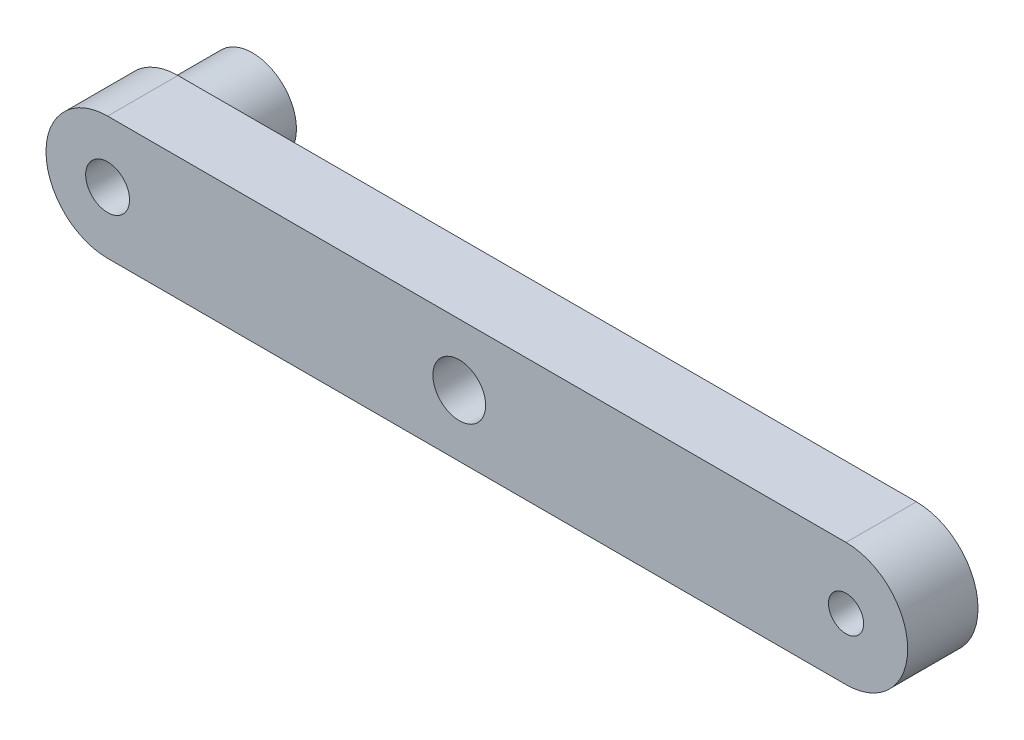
ISO-10303-21;
HEADER;
FILE_DESCRIPTION(('STEP AP214'),'2;1');
FILE_NAME('part.step','',(''),(''),'','','');
FILE_SCHEMA(('AUTOMOTIVE_DESIGN { 1 0 10303 214 1 1 1 1 }'));
ENDSEC;
DATA;
#1=APPLICATION_CONTEXT('core data for automotive mechanical design processes');
#2=APPLICATION_PROTOCOL_DEFINITION('international standard','automotive_design',2000,#1);
#3=PRODUCT_CONTEXT('',#1,'mechanical');
#4=PRODUCT('Part','Part','',(#3));
#5=PRODUCT_RELATED_PRODUCT_CATEGORY('part','',(#4));
#6=PRODUCT_DEFINITION_FORMATION('','',#4);
#7=PRODUCT_DEFINITION_CONTEXT('part definition',#1,'design');
#8=PRODUCT_DEFINITION('design','',#6,#7);
#9=PRODUCT_DEFINITION_SHAPE('','',#8);
#10=(LENGTH_UNIT() NAMED_UNIT(*) SI_UNIT(.MILLI.,.METRE.));
#11=(NAMED_UNIT(*) PLANE_ANGLE_UNIT() SI_UNIT($,.RADIAN.));
#12=(NAMED_UNIT(*) SI_UNIT($,.STERADIAN.) SOLID_ANGLE_UNIT());
#13=UNCERTAINTY_MEASURE_WITH_UNIT(LENGTH_MEASURE(1.E-05),#10,'distance_accuracy_value','');
#14=(GEOMETRIC_REPRESENTATION_CONTEXT(3) GLOBAL_UNCERTAINTY_ASSIGNED_CONTEXT((#13)) GLOBAL_UNIT_ASSIGNED_CONTEXT((#10,
#11,#12)) REPRESENTATION_CONTEXT('',''));
#15=CARTESIAN_POINT('',(0.,0.,0.));
#16=DIRECTION('',(0.,0.,1.));
#17=DIRECTION('',(1.,0.,0.));
#18=AXIS2_PLACEMENT_3D('',#15,#16,#17);
#19=CARTESIAN_POINT('',(-63.5,0.,-13.462));
#20=DIRECTION('',(0.,0.,1.));
#21=DIRECTION('',(1.,0.,0.));
#22=AXIS2_PLACEMENT_3D('',#19,#20,#21);
#23=CYLINDRICAL_SURFACE('',#22,7.93749999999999);
#24=CARTESIAN_POINT('',(-63.5,0.,-13.462));
#25=DIRECTION('',(0.,0.,1.));
#26=DIRECTION('',(1.,0.,0.));
#27=AXIS2_PLACEMENT_3D('',#24,#25,#26);
#28=CIRCLE('',#27,7.93749999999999);
#29=CARTESIAN_POINT('',(-55.5625,0.,-13.462));
#30=VERTEX_POINT('',#29);
#31=EDGE_CURVE('E11',#30,#30,#28,.T.);
#32=ORIENTED_EDGE('',*,*,#31,.T.);
#33=EDGE_LOOP('',(#32));
#34=FACE_BOUND('',#33,.T.);
#35=CARTESIAN_POINT('',(-63.5,0.,0.));
#36=DIRECTION('',(0.,0.,1.));
#37=DIRECTION('',(1.,0.,0.));
#38=AXIS2_PLACEMENT_3D('',#35,#36,#37);
#39=CIRCLE('',#38,7.93749999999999);
#40=CARTESIAN_POINT('',(-55.5625,0.,0.));
#41=VERTEX_POINT('',#40);
#42=EDGE_CURVE('E48',#41,#41,#39,.T.);
#43=ORIENTED_EDGE('',*,*,#42,.F.);
#44=EDGE_LOOP('',(#43));
#45=FACE_BOUND('',#44,.T.);
#46=ADVANCED_FACE('F45',(#34,#45),#23,.T.);
#47=CARTESIAN_POINT('',(-63.5,0.,-13.462));
#48=DIRECTION('',(0.,0.,1.));
#49=DIRECTION('',(1.,0.,0.));
#50=AXIS2_PLACEMENT_3D('',#47,#48,#49);
#51=PLANE('',#50);
#52=ORIENTED_EDGE('',*,*,#31,.F.);
#53=EDGE_LOOP('',(#52));
#54=FACE_BOUND('',#53,.T.);
#55=ADVANCED_FACE('F60',(#54),#51,.F.);
#56=CARTESIAN_POINT('',(-63.5,0.,0.));
#57=DIRECTION('',(0.,0.,1.));
#58=DIRECTION('',(1.,0.,0.));
#59=AXIS2_PLACEMENT_3D('',#56,#57,#58);
#60=PLANE('',#59);
#61=ORIENTED_EDGE('',*,*,#42,.T.);
#62=EDGE_LOOP('',(#61));
#63=FACE_BOUND('',#62,.T.);
#64=ADVANCED_FACE('F57',(#63),#60,.T.);
#65=CLOSED_SHELL('',(#46,#55,#64));
#66=MANIFOLD_SOLID_BREP('B2',#65);
#67=CARTESIAN_POINT('',(-63.5,0.,12.7));
#68=DIRECTION('',(0.,0.,1.));
#69=DIRECTION('',(1.,0.,0.));
#70=AXIS2_PLACEMENT_3D('',#67,#68,#69);
#71=PLANE('',#70);
#72=CARTESIAN_POINT('',(0.,0.,12.7));
#73=DIRECTION('',(0.,0.,1.));
#74=DIRECTION('',(1.,0.,0.));
#75=AXIS2_PLACEMENT_3D('',#72,#73,#74);
#76=CIRCLE('',#75,4.7625);
#77=CARTESIAN_POINT('',(4.7625,0.,12.7));
#78=VERTEX_POINT('',#77);
#79=EDGE_CURVE('E168',#78,#78,#76,.T.);
#80=ORIENTED_EDGE('',*,*,#79,.F.);
#81=EDGE_LOOP('',(#80));
#82=FACE_BOUND('',#81,.T.);
#83=CARTESIAN_POINT('',(-63.5,0.,12.7));
#84=DIRECTION('',(0.,0.,1.));
#85=DIRECTION('',(1.,0.,0.));
#86=AXIS2_PLACEMENT_3D('',#83,#84,#85);
#87=CIRCLE('',#86,11.1251999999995);
#88=CARTESIAN_POINT('',(-63.5,11.1251999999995,12.7));
#89=VERTEX_POINT('',#88);
#90=CARTESIAN_POINT('',(-63.5000000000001,-11.1251999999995,12.7));
#91=VERTEX_POINT('',#90);
#92=EDGE_CURVE('E138',#89,#91,#87,.T.);
#93=ORIENTED_EDGE('',*,*,#92,.T.);
#94=DIRECTION('',(1.,0.,0.));
#95=VECTOR('',#94,1.);
#96=CARTESIAN_POINT('',(-63.5000000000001,-11.1251999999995,12.7));
#97=LINE('',#96,#95);
#98=CARTESIAN_POINT('',(69.8499999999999,-11.1252000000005,12.7));
#99=VERTEX_POINT('',#98);
#100=EDGE_CURVE('E133',#91,#99,#97,.T.);
#101=ORIENTED_EDGE('',*,*,#100,.T.);
#102=CARTESIAN_POINT('',(69.85,-4.79205785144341E-13,12.7));
#103=DIRECTION('',(0.,0.,1.));
#104=DIRECTION('',(1.,0.,0.));
#105=AXIS2_PLACEMENT_3D('',#102,#103,#104);
#106=CIRCLE('',#105,11.1252);
#107=CARTESIAN_POINT('',(69.85,11.1251999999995,12.7));
#108=VERTEX_POINT('',#107);
#109=EDGE_CURVE('E136',#99,#108,#106,.T.);
#110=ORIENTED_EDGE('',*,*,#109,.T.);
#111=DIRECTION('',(-1.,0.,0.));
#112=VECTOR('',#111,1.);
#113=CARTESIAN_POINT('',(69.85,11.1251999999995,12.7));
#114=LINE('',#113,#112);
#115=EDGE_CURVE('E103',#108,#89,#114,.T.);
#116=ORIENTED_EDGE('',*,*,#115,.T.);
#117=EDGE_LOOP('',(#93,#101,#110,#116));
#118=FACE_BOUND('',#117,.T.);
#119=CARTESIAN_POINT('',(-63.5,0.,12.7));
#120=DIRECTION('',(0.,0.,1.));
#121=DIRECTION('',(1.,0.,0.));
#122=AXIS2_PLACEMENT_3D('',#119,#120,#121);
#123=CIRCLE('',#122,3.9624);
#124=CARTESIAN_POINT('',(-59.5376,0.,12.7));
#125=VERTEX_POINT('',#124);
#126=EDGE_CURVE('E153',#125,#125,#123,.T.);
#127=ORIENTED_EDGE('',*,*,#126,.F.);
#128=EDGE_LOOP('',(#127));
#129=FACE_BOUND('',#128,.T.);
#130=CARTESIAN_POINT('',(69.85,-4.79205785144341E-13,12.7));
#131=DIRECTION('',(0.,0.,1.));
#132=DIRECTION('',(1.,0.,0.));
#133=AXIS2_PLACEMENT_3D('',#130,#131,#132);
#134=CIRCLE('',#133,3.17500000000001);
#135=CARTESIAN_POINT('',(73.025,-4.79205785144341E-13,12.7));
#136=VERTEX_POINT('',#135);
#137=EDGE_CURVE('E174',#136,#136,#134,.T.);
#138=ORIENTED_EDGE('',*,*,#137,.F.);
#139=EDGE_LOOP('',(#138));
#140=FACE_BOUND('',#139,.T.);
#141=ADVANCED_FACE('F86',(#82,#118,#129,#140),#71,.T.);
#142=CARTESIAN_POINT('',(-63.5,0.,0.));
#143=DIRECTION('',(0.,0.,1.));
#144=DIRECTION('',(1.,0.,0.));
#145=AXIS2_PLACEMENT_3D('',#142,#143,#144);
#146=PLANE('',#145);
#147=CARTESIAN_POINT('',(0.,0.,0.));
#148=DIRECTION('',(0.,0.,1.));
#149=DIRECTION('',(1.,0.,0.));
#150=AXIS2_PLACEMENT_3D('',#147,#148,#149);
#151=CIRCLE('',#150,4.7625);
#152=CARTESIAN_POINT('',(4.7625,0.,0.));
#153=VERTEX_POINT('',#152);
#154=EDGE_CURVE('E171',#153,#153,#151,.T.);
#155=ORIENTED_EDGE('',*,*,#154,.T.);
#156=EDGE_LOOP('',(#155));
#157=FACE_BOUND('',#156,.T.);
#158=CARTESIAN_POINT('',(-63.5,0.,0.));
#159=DIRECTION('',(0.,0.,1.));
#160=DIRECTION('',(1.,0.,0.));
#161=AXIS2_PLACEMENT_3D('',#158,#159,#160);
#162=CIRCLE('',#161,11.1251999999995);
#163=CARTESIAN_POINT('',(-63.5,11.1251999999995,0.));
#164=VERTEX_POINT('',#163);
#165=CARTESIAN_POINT('',(-63.5000000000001,-11.1251999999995,0.));
#166=VERTEX_POINT('',#165);
#167=EDGE_CURVE('E150',#164,#166,#162,.T.);
#168=ORIENTED_EDGE('',*,*,#167,.F.);
#169=DIRECTION('',(-1.,0.,0.));
#170=VECTOR('',#169,1.);
#171=CARTESIAN_POINT('',(69.85,11.1251999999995,0.));
#172=LINE('',#171,#170);
#173=CARTESIAN_POINT('',(69.85,11.1251999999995,0.));
#174=VERTEX_POINT('',#173);
#175=EDGE_CURVE('E126',#174,#164,#172,.T.);
#176=ORIENTED_EDGE('',*,*,#175,.F.);
#177=CARTESIAN_POINT('',(69.85,-4.79205785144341E-13,0.));
#178=DIRECTION('',(0.,0.,1.));
#179=DIRECTION('',(1.,0.,0.));
#180=AXIS2_PLACEMENT_3D('',#177,#178,#179);
#181=CIRCLE('',#180,11.1252);
#182=CARTESIAN_POINT('',(69.8499999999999,-11.1252000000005,0.));
#183=VERTEX_POINT('',#182);
#184=EDGE_CURVE('E120',#183,#174,#181,.T.);
#185=ORIENTED_EDGE('',*,*,#184,.F.);
#186=DIRECTION('',(1.,0.,0.));
#187=VECTOR('',#186,1.);
#188=CARTESIAN_POINT('',(-63.5000000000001,-11.1251999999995,0.));
#189=LINE('',#188,#187);
#190=EDGE_CURVE('E142',#166,#183,#189,.T.);
#191=ORIENTED_EDGE('',*,*,#190,.F.);
#192=EDGE_LOOP('',(#168,#176,#185,#191));
#193=FACE_BOUND('',#192,.T.);
#194=CARTESIAN_POINT('',(-63.5,0.,0.));
#195=DIRECTION('',(0.,0.,1.));
#196=DIRECTION('',(1.,0.,0.));
#197=AXIS2_PLACEMENT_3D('',#194,#195,#196);
#198=CIRCLE('',#197,3.9624);
#199=CARTESIAN_POINT('',(-59.5376,0.,0.));
#200=VERTEX_POINT('',#199);
#201=EDGE_CURVE('E165',#200,#200,#198,.T.);
#202=ORIENTED_EDGE('',*,*,#201,.T.);
#203=EDGE_LOOP('',(#202));
#204=FACE_BOUND('',#203,.T.);
#205=CARTESIAN_POINT('',(69.85,-4.79205785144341E-13,0.));
#206=DIRECTION('',(0.,0.,1.));
#207=DIRECTION('',(1.,0.,0.));
#208=AXIS2_PLACEMENT_3D('',#205,#206,#207);
#209=CIRCLE('',#208,3.17500000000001);
#210=CARTESIAN_POINT('',(73.025,-4.79205785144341E-13,0.));
#211=VERTEX_POINT('',#210);
#212=EDGE_CURVE('E177',#211,#211,#209,.T.);
#213=ORIENTED_EDGE('',*,*,#212,.T.);
#214=EDGE_LOOP('',(#213));
#215=FACE_BOUND('',#214,.T.);
#216=ADVANCED_FACE('F161',(#157,#193,#204,#215),#146,.F.);
#217=CARTESIAN_POINT('',(-63.5,0.,12.7));
#218=DIRECTION('',(0.,0.,-1.));
#219=DIRECTION('',(-1.,0.,0.));
#220=AXIS2_PLACEMENT_3D('',#217,#218,#219);
#221=CYLINDRICAL_SURFACE('',#220,11.1251999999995);
#222=ORIENTED_EDGE('',*,*,#167,.T.);
#223=DIRECTION('',(0.,0.,-1.));
#224=VECTOR('',#223,1.);
#225=CARTESIAN_POINT('',(-63.5000000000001,-11.1251999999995,12.7));
#226=LINE('',#225,#224);
#227=EDGE_CURVE('E43',#91,#166,#226,.T.);
#228=ORIENTED_EDGE('',*,*,#227,.F.);
#229=ORIENTED_EDGE('',*,*,#92,.F.);
#230=DIRECTION('',(0.,0.,-1.));
#231=VECTOR('',#230,1.);
#232=CARTESIAN_POINT('',(-63.5,11.1251999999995,12.7));
#233=LINE('',#232,#231);
#234=EDGE_CURVE('E146',#89,#164,#233,.T.);
#235=ORIENTED_EDGE('',*,*,#234,.T.);
#236=EDGE_LOOP('',(#222,#228,#229,#235));
#237=FACE_BOUND('',#236,.T.);
#238=ADVANCED_FACE('F88',(#237),#221,.T.);
#239=CARTESIAN_POINT('',(-63.5000000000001,-11.1251999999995,12.7));
#240=DIRECTION('',(0.,1.,0.));
#241=DIRECTION('',(-1.,0.,0.));
#242=AXIS2_PLACEMENT_3D('',#239,#240,#241);
#243=PLANE('',#242);
#244=ORIENTED_EDGE('',*,*,#190,.T.);
#245=DIRECTION('',(0.,0.,-1.));
#246=VECTOR('',#245,1.);
#247=CARTESIAN_POINT('',(69.8499999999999,-11.1252000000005,12.7));
#248=LINE('',#247,#246);
#249=EDGE_CURVE('E95',#99,#183,#248,.T.);
#250=ORIENTED_EDGE('',*,*,#249,.F.);
#251=ORIENTED_EDGE('',*,*,#100,.F.);
#252=ORIENTED_EDGE('',*,*,#227,.T.);
#253=EDGE_LOOP('',(#244,#250,#251,#252));
#254=FACE_BOUND('',#253,.T.);
#255=ADVANCED_FACE('F141',(#254),#243,.F.);
#256=CARTESIAN_POINT('',(69.85,-4.79205785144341E-13,12.7));
#257=DIRECTION('',(0.,0.,-1.));
#258=DIRECTION('',(-1.,0.,0.));
#259=AXIS2_PLACEMENT_3D('',#256,#257,#258);
#260=CYLINDRICAL_SURFACE('',#259,11.1252);
#261=ORIENTED_EDGE('',*,*,#184,.T.);
#262=DIRECTION('',(0.,0.,-1.));
#263=VECTOR('',#262,1.);
#264=CARTESIAN_POINT('',(69.85,11.1251999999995,12.7));
#265=LINE('',#264,#263);
#266=EDGE_CURVE('E143',#108,#174,#265,.T.);
#267=ORIENTED_EDGE('',*,*,#266,.F.);
#268=ORIENTED_EDGE('',*,*,#109,.F.);
#269=ORIENTED_EDGE('',*,*,#249,.T.);
#270=EDGE_LOOP('',(#261,#267,#268,#269));
#271=FACE_BOUND('',#270,.T.);
#272=ADVANCED_FACE('F144',(#271),#260,.T.);
#273=CARTESIAN_POINT('',(69.85,11.1251999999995,12.7));
#274=DIRECTION('',(0.,-1.,0.));
#275=DIRECTION('',(1.,0.,0.));
#276=AXIS2_PLACEMENT_3D('',#273,#274,#275);
#277=PLANE('',#276);
#278=ORIENTED_EDGE('',*,*,#175,.T.);
#279=ORIENTED_EDGE('',*,*,#234,.F.);
#280=ORIENTED_EDGE('',*,*,#115,.F.);
#281=ORIENTED_EDGE('',*,*,#266,.T.);
#282=EDGE_LOOP('',(#278,#279,#280,#281));
#283=FACE_BOUND('',#282,.T.);
#284=ADVANCED_FACE('F158',(#283),#277,.F.);
#285=CARTESIAN_POINT('',(-63.5,0.,12.7));
#286=DIRECTION('',(0.,0.,-1.));
#287=DIRECTION('',(-1.,0.,0.));
#288=AXIS2_PLACEMENT_3D('',#285,#286,#287);
#289=CYLINDRICAL_SURFACE('',#288,3.9624);
#290=ORIENTED_EDGE('',*,*,#126,.T.);
#291=EDGE_LOOP('',(#290));
#292=FACE_BOUND('',#291,.T.);
#293=ORIENTED_EDGE('',*,*,#201,.F.);
#294=EDGE_LOOP('',(#293));
#295=FACE_BOUND('',#294,.T.);
#296=ADVANCED_FACE('F196',(#292,#295),#289,.F.);
#297=CARTESIAN_POINT('',(0.,0.,12.7));
#298=DIRECTION('',(0.,0.,-1.));
#299=DIRECTION('',(-1.,0.,0.));
#300=AXIS2_PLACEMENT_3D('',#297,#298,#299);
#301=CYLINDRICAL_SURFACE('',#300,4.7625);
#302=ORIENTED_EDGE('',*,*,#79,.T.);
#303=EDGE_LOOP('',(#302));
#304=FACE_BOUND('',#303,.T.);
#305=ORIENTED_EDGE('',*,*,#154,.F.);
#306=EDGE_LOOP('',(#305));
#307=FACE_BOUND('',#306,.T.);
#308=ADVANCED_FACE('F242',(#304,#307),#301,.F.);
#309=CARTESIAN_POINT('',(69.85,-4.79205785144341E-13,12.7));
#310=DIRECTION('',(0.,0.,-1.));
#311=DIRECTION('',(-1.,0.,0.));
#312=AXIS2_PLACEMENT_3D('',#309,#310,#311);
#313=CYLINDRICAL_SURFACE('',#312,3.17500000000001);
#314=ORIENTED_EDGE('',*,*,#137,.T.);
#315=EDGE_LOOP('',(#314));
#316=FACE_BOUND('',#315,.T.);
#317=ORIENTED_EDGE('',*,*,#212,.F.);
#318=EDGE_LOOP('',(#317));
#319=FACE_BOUND('',#318,.T.);
#320=ADVANCED_FACE('F183',(#316,#319),#313,.F.);
#321=CLOSED_SHELL('',(#141,#216,#238,#255,#272,#284,#296,#308,#320));
#322=MANIFOLD_SOLID_BREP('B6',#321);
#323=ADVANCED_BREP_SHAPE_REPRESENTATION('',(#18,#66,#322),#14);
#324=SHAPE_DEFINITION_REPRESENTATION(#9,#323);
ENDSEC;
END-ISO-10303-21;
